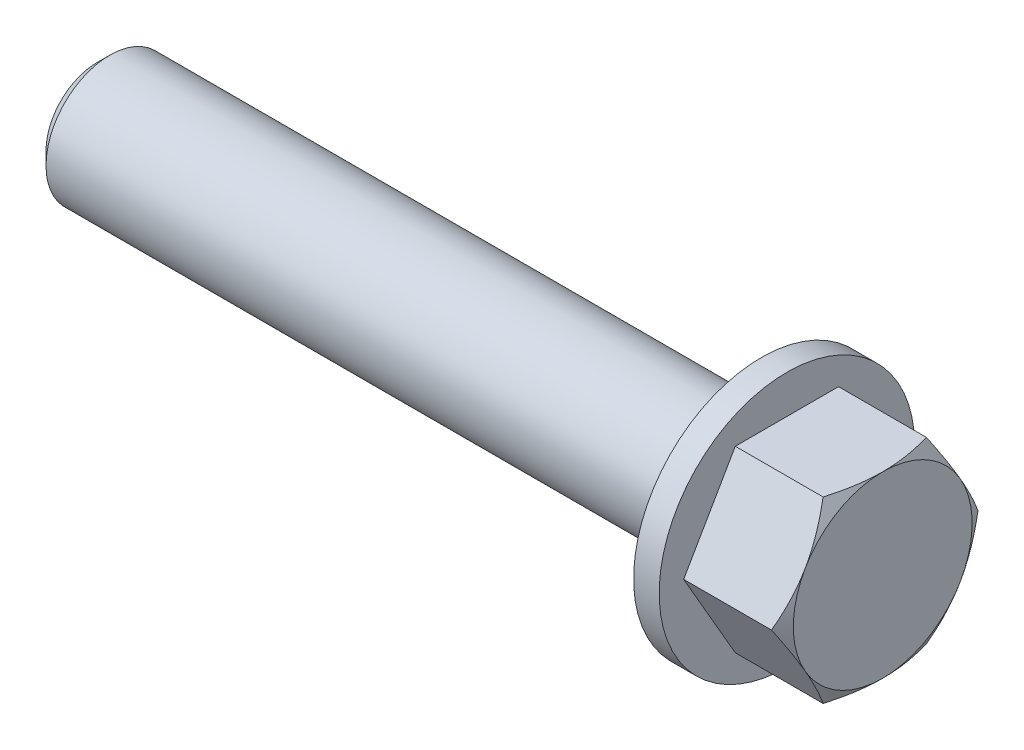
ISO-10303-21;
HEADER;
FILE_DESCRIPTION(('STEP AP214'),'2;1');
FILE_NAME('part.step','',(''),(''),'','','');
FILE_SCHEMA(('AUTOMOTIVE_DESIGN { 1 0 10303 214 1 1 1 1 }'));
ENDSEC;
DATA;
#1=APPLICATION_CONTEXT('core data for automotive mechanical design processes');
#2=APPLICATION_PROTOCOL_DEFINITION('international standard','automotive_design',2000,#1);
#3=PRODUCT_CONTEXT('',#1,'mechanical');
#4=PRODUCT('Part','Part','',(#3));
#5=PRODUCT_RELATED_PRODUCT_CATEGORY('part','',(#4));
#6=PRODUCT_DEFINITION_FORMATION('','',#4);
#7=PRODUCT_DEFINITION_CONTEXT('part definition',#1,'design');
#8=PRODUCT_DEFINITION('design','',#6,#7);
#9=PRODUCT_DEFINITION_SHAPE('','',#8);
#10=(LENGTH_UNIT() NAMED_UNIT(*) SI_UNIT(.MILLI.,.METRE.));
#11=(NAMED_UNIT(*) PLANE_ANGLE_UNIT() SI_UNIT($,.RADIAN.));
#12=(NAMED_UNIT(*) SI_UNIT($,.STERADIAN.) SOLID_ANGLE_UNIT());
#13=UNCERTAINTY_MEASURE_WITH_UNIT(LENGTH_MEASURE(1.E-05),#10,'distance_accuracy_value','');
#14=(GEOMETRIC_REPRESENTATION_CONTEXT(3) GLOBAL_UNCERTAINTY_ASSIGNED_CONTEXT((#13)) GLOBAL_UNIT_ASSIGNED_CONTEXT((#10,
#11,#12)) REPRESENTATION_CONTEXT('',''));
#15=CARTESIAN_POINT('',(0.,0.,0.));
#16=DIRECTION('',(0.,0.,1.));
#17=DIRECTION('',(1.,0.,0.));
#18=AXIS2_PLACEMENT_3D('',#15,#16,#17);
#19=CARTESIAN_POINT('',(7.5,-7.,-4.04145188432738));
#20=DIRECTION('',(0.,0.5,0.866025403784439));
#21=DIRECTION('',(0.,-0.866025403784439,0.5));
#22=AXIS2_PLACEMENT_3D('',#19,#20,#21);
#23=PLANE('',#22);
#24=DIRECTION('',(-1.,0.,0.));
#25=VECTOR('',#24,1.);
#26=CARTESIAN_POINT('',(7.5,0.,-8.08290376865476));
#27=LINE('',#26,#25);
#28=CARTESIAN_POINT('',(6.87478521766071,0.,-8.08290376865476));
#29=VERTEX_POINT('',#28);
#30=CARTESIAN_POINT('',(0.,0.,-8.08290376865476));
#31=VERTEX_POINT('',#30);
#32=EDGE_CURVE('E145',#29,#31,#27,.T.);
#33=ORIENTED_EDGE('',*,*,#32,.F.);
#34=CARTESIAN_POINT('',(6.8747185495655,0.0002,-8.0830192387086));
#35=CARTESIAN_POINT('',(6.92600015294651,-0.153667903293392,-7.99418356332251));
#36=CARTESIAN_POINT('',(6.97495440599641,-0.308109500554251,-7.90501666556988));
#37=CARTESIAN_POINT('',(7.06756721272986,-0.618246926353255,-7.72595873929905));
#38=CARTESIAN_POINT('',(7.11122348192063,-0.773943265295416,-7.63606741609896));
#39=CARTESIAN_POINT('',(7.2333884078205,-1.24352516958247,-7.36495417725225));
#40=CARTESIAN_POINT('',(7.30287444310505,-1.5592643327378,-7.18266208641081));
#41=CARTESIAN_POINT('',(7.3843550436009,-2.03176224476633,-6.9098652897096));
#42=CARTESIAN_POINT('',(7.40756651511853,-2.18710922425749,-6.82017566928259));
#43=CARTESIAN_POINT('',(7.44648878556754,-2.49850511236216,-6.64039116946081));
#44=CARTESIAN_POINT('',(7.46220024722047,-2.65455395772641,-6.55029632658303));
#45=CARTESIAN_POINT('',(7.48572208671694,-2.96692267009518,-6.36995016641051));
#46=CARTESIAN_POINT('',(7.49354143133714,-3.12324202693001,-6.27969914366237));
#47=CARTESIAN_POINT('',(7.50111975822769,-3.43601650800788,-6.09911871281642));
#48=CARTESIAN_POINT('',(7.50087898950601,-3.59247162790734,-6.00878930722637));
#49=CARTESIAN_POINT('',(7.4891402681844,-4.02110687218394,-5.76131663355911));
#50=CARTESIAN_POINT('',(7.46943425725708,-4.2931466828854,-5.60425437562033));
#51=CARTESIAN_POINT('',(7.40694653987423,-4.8354194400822,-5.29117305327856));
#52=CARTESIAN_POINT('',(7.36414347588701,-5.10565047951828,-5.13515508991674));
#53=CARTESIAN_POINT('',(7.25714832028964,-5.64901454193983,-4.82144370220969));
#54=CARTESIAN_POINT('',(7.19250290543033,-5.92207900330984,-4.66378986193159));
#55=CARTESIAN_POINT('',(7.04578392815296,-6.46413578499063,-4.35083323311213));
#56=CARTESIAN_POINT('',(6.96374482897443,-6.73313504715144,-4.19552643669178));
#57=CARTESIAN_POINT('',(6.8747185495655,-7.0002,-4.04133641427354));
#58=B_SPLINE_CURVE_WITH_KNOTS('',3,(#34,#35,#36,#37,#38,#39,#40,#41,#42,#43,#44,#45,#46,#47,#48,
#49,#50,#51,#52,#53,#54,#55,#56,#57),.UNSPECIFIED.,.F.,.F.,(4,2,2,2,2,2,2,2,2,2,2,4),(0.,
0.554727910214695,1.10969417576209,2.2219327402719,2.76443041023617,3.30688013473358,
3.8487128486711,4.39052882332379,5.33376515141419,6.27787517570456,7.2429241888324,
8.20607866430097),.UNSPECIFIED.);
#59=CARTESIAN_POINT('',(7.5,-3.5,-6.06217782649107));
#60=VERTEX_POINT('',#59);
#61=EDGE_CURVE('E228',#29,#60,#58,.T.);
#62=ORIENTED_EDGE('',*,*,#61,.T.);
#63=CARTESIAN_POINT('',(6.87478521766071,-7.,-4.04145188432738));
#64=VERTEX_POINT('',#63);
#65=EDGE_CURVE('E230',#60,#64,#58,.T.);
#66=ORIENTED_EDGE('',*,*,#65,.T.);
#67=DIRECTION('',(-1.,0.,0.));
#68=VECTOR('',#67,1.);
#69=CARTESIAN_POINT('',(7.5,-7.,-4.04145188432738));
#70=LINE('',#69,#68);
#71=CARTESIAN_POINT('',(0.,-7.,-4.04145188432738));
#72=VERTEX_POINT('',#71);
#73=EDGE_CURVE('E117',#64,#72,#70,.T.);
#74=ORIENTED_EDGE('',*,*,#73,.T.);
#75=DIRECTION('',(0.,0.866025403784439,-0.5));
#76=VECTOR('',#75,1.);
#77=CARTESIAN_POINT('',(0.,-7.,-4.04145188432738));
#78=LINE('',#77,#76);
#79=EDGE_CURVE('E113',#72,#31,#78,.T.);
#80=ORIENTED_EDGE('',*,*,#79,.T.);
#81=EDGE_LOOP('',(#33,#62,#66,#74,#80));
#82=FACE_BOUND('',#81,.T.);
#83=ADVANCED_FACE('F36',(#82),#23,.F.);
#84=CARTESIAN_POINT('',(7.5,0.,-8.08290376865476));
#85=DIRECTION('',(0.,-0.5,0.866025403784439));
#86=DIRECTION('',(0.,-0.866025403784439,-0.5));
#87=AXIS2_PLACEMENT_3D('',#84,#85,#86);
#88=PLANE('',#87);
#89=DIRECTION('',(-1.,0.,0.));
#90=VECTOR('',#89,1.);
#91=CARTESIAN_POINT('',(7.5,7.,-4.04145188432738));
#92=LINE('',#91,#90);
#93=CARTESIAN_POINT('',(6.87478521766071,7.,-4.04145188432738));
#94=VERTEX_POINT('',#93);
#95=CARTESIAN_POINT('',(0.,7.,-4.04145188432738));
#96=VERTEX_POINT('',#95);
#97=EDGE_CURVE('E142',#94,#96,#92,.T.);
#98=ORIENTED_EDGE('',*,*,#97,.F.);
#99=CARTESIAN_POINT('',(6.8747185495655,7.0002,-4.04133641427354));
#100=CARTESIAN_POINT('',(6.92600015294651,6.84633209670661,-4.13017208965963));
#101=CARTESIAN_POINT('',(6.97495440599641,6.69189049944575,-4.21933898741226));
#102=CARTESIAN_POINT('',(7.06756721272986,6.38175307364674,-4.39839691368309));
#103=CARTESIAN_POINT('',(7.11122348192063,6.22605673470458,-4.48828823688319));
#104=CARTESIAN_POINT('',(7.2333884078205,5.75647483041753,-4.75940147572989));
#105=CARTESIAN_POINT('',(7.30287444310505,5.4407356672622,-4.94169356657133));
#106=CARTESIAN_POINT('',(7.3843550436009,4.96823775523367,-5.21449036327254));
#107=CARTESIAN_POINT('',(7.40756651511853,4.81289077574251,-5.30417998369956));
#108=CARTESIAN_POINT('',(7.44648878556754,4.50149488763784,-5.48396448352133));
#109=CARTESIAN_POINT('',(7.46220024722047,4.34544604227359,-5.57405932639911));
#110=CARTESIAN_POINT('',(7.48572208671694,4.03307732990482,-5.75440548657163));
#111=CARTESIAN_POINT('',(7.49354143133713,3.87675797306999,-5.84465650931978));
#112=CARTESIAN_POINT('',(7.50111975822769,3.56398349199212,-6.02523694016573));
#113=CARTESIAN_POINT('',(7.50087898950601,3.40752837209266,-6.11556634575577));
#114=CARTESIAN_POINT('',(7.4891402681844,2.97889312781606,-6.36303901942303));
#115=CARTESIAN_POINT('',(7.46943425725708,2.7068533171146,-6.52010127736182));
#116=CARTESIAN_POINT('',(7.40694653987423,2.1645805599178,-6.83318259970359));
#117=CARTESIAN_POINT('',(7.36414347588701,1.89434952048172,-6.9892005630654));
#118=CARTESIAN_POINT('',(7.25714832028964,1.35098545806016,-7.30291195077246));
#119=CARTESIAN_POINT('',(7.19250290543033,1.07792099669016,-7.46056579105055));
#120=CARTESIAN_POINT('',(7.04578392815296,0.535864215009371,-7.77352241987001));
#121=CARTESIAN_POINT('',(6.96374482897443,0.26686495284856,-7.92882921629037));
#122=CARTESIAN_POINT('',(6.8747185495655,-0.000200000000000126,-8.0830192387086));
#123=B_SPLINE_CURVE_WITH_KNOTS('',3,(#99,#100,#101,#102,#103,#104,#105,#106,#107,#108,#109,#110,
#111,#112,#113,#114,#115,#116,#117,#118,#119,#120,#121,#122),.UNSPECIFIED.,.F.,.F.,(4,2,2,2,2,2,
2,2,2,2,2,4),(0.,0.554727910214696,1.10969417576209,2.2219327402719,2.76443041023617,
3.30688013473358,3.8487128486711,4.39052882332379,5.33376515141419,6.27787517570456,
7.2429241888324,8.20607866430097),.UNSPECIFIED.);
#124=CARTESIAN_POINT('',(7.5,3.5,-6.06217782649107));
#125=VERTEX_POINT('',#124);
#126=EDGE_CURVE('E219',#94,#125,#123,.T.);
#127=ORIENTED_EDGE('',*,*,#126,.T.);
#128=EDGE_CURVE('E193',#125,#29,#123,.T.);
#129=ORIENTED_EDGE('',*,*,#128,.T.);
#130=ORIENTED_EDGE('',*,*,#32,.T.);
#131=DIRECTION('',(0.,0.866025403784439,0.5));
#132=VECTOR('',#131,1.);
#133=CARTESIAN_POINT('',(0.,0.,-8.08290376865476));
#134=LINE('',#133,#132);
#135=EDGE_CURVE('E184',#31,#96,#134,.T.);
#136=ORIENTED_EDGE('',*,*,#135,.T.);
#137=EDGE_LOOP('',(#98,#127,#129,#130,#136));
#138=FACE_BOUND('',#137,.T.);
#139=ADVANCED_FACE('F207',(#138),#88,.F.);
#140=CARTESIAN_POINT('',(7.5,7.,-4.04145188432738));
#141=DIRECTION('',(0.,-1.,0.));
#142=DIRECTION('',(0.,0.,-1.));
#143=AXIS2_PLACEMENT_3D('',#140,#141,#142);
#144=PLANE('',#143);
#145=DIRECTION('',(-1.,0.,0.));
#146=VECTOR('',#145,1.);
#147=CARTESIAN_POINT('',(7.5,6.99999999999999,4.04145188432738));
#148=LINE('',#147,#146);
#149=CARTESIAN_POINT('',(6.87478521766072,6.99999999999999,4.04145188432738));
#150=VERTEX_POINT('',#149);
#151=CARTESIAN_POINT('',(0.,6.99999999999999,4.04145188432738));
#152=VERTEX_POINT('',#151);
#153=EDGE_CURVE('E139',#150,#152,#148,.T.);
#154=ORIENTED_EDGE('',*,*,#153,.F.);
#155=CARTESIAN_POINT('',(4.06584479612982,7.00000000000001,-10.8928464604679));
#156=CARTESIAN_POINT('',(4.21450026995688,7.00000000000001,-10.5867029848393));
#157=CARTESIAN_POINT('',(4.36174066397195,7.,-10.2798605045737));
#158=CARTESIAN_POINT('',(4.65259582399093,7.,-9.66440574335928));
#159=CARTESIAN_POINT('',(4.79621002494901,7.,-9.35579319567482));
#160=CARTESIAN_POINT('',(5.07973140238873,7.,-8.73485529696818));
#161=CARTESIAN_POINT('',(5.21961447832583,7.,-8.4225189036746));
#162=CARTESIAN_POINT('',(5.49370236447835,7.,-7.7953737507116));
#163=CARTESIAN_POINT('',(5.62790744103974,7.,-7.48056510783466));
#164=CARTESIAN_POINT('',(5.89331373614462,7.,-6.8378693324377));
#165=CARTESIAN_POINT('',(6.0242822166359,7.,-6.50988555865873));
#166=CARTESIAN_POINT('',(6.27639631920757,7.,-5.85009595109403));
#167=CARTESIAN_POINT('',(6.39754084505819,7.,-5.51828969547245));
#168=CARTESIAN_POINT('',(6.62685500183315,7.,-4.85093135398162));
#169=CARTESIAN_POINT('',(6.73505052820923,7.,-4.51538826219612));
#170=CARTESIAN_POINT('',(6.93502168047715,7.,-3.83950215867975));
#171=CARTESIAN_POINT('',(7.02680243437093,7.,-3.49916068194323));
#172=CARTESIAN_POINT('',(7.1890943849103,7.,-2.81522305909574));
#173=CARTESIAN_POINT('',(7.25971625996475,7.,-2.47165390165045));
#174=CARTESIAN_POINT('',(7.34671847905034,7.,-1.95314285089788));
#175=CARTESIAN_POINT('',(7.37256524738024,7.,-1.77976757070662));
#176=CARTESIAN_POINT('',(7.41744250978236,7.,-1.43214350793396));
#177=CARTESIAN_POINT('',(7.436473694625,7.,-1.25789481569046));
#178=CARTESIAN_POINT('',(7.467100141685,7.,-0.911049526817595));
#179=CARTESIAN_POINT('',(7.47878980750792,7.,-0.738461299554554));
#180=CARTESIAN_POINT('',(7.49485833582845,7.,-0.392945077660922));
#181=CARTESIAN_POINT('',(7.49923732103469,7.,-0.220017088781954));
#182=CARTESIAN_POINT('',(7.50057992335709,7.,0.125872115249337));
#183=CARTESIAN_POINT('',(7.49754340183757,7.,0.2988333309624));
#184=CARTESIAN_POINT('',(7.48412945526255,7.,0.644473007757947));
#185=CARTESIAN_POINT('',(7.47375167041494,7.,0.817151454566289));
#186=CARTESIAN_POINT('',(7.44031338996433,7.,1.23087218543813));
#187=CARTESIAN_POINT('',(7.41384108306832,7.,1.47164462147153));
#188=CARTESIAN_POINT('',(7.34805815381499,7.,1.9514167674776));
#189=CARTESIAN_POINT('',(7.30874582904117,6.99999999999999,2.19041623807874));
#190=CARTESIAN_POINT('',(7.17363274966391,6.99999999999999,2.90445905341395));
#191=CARTESIAN_POINT('',(7.06067846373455,6.99999999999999,3.37630026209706));
#192=CARTESIAN_POINT('',(6.86454385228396,6.99999999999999,4.0821986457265));
#193=CARTESIAN_POINT('',(6.79374157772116,6.99999999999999,4.31990513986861));
#194=CARTESIAN_POINT('',(6.64473048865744,6.99999999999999,4.7930081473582));
#195=CARTESIAN_POINT('',(6.5665216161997,6.99999999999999,5.02840464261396));
#196=CARTESIAN_POINT('',(6.40395697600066,6.99999999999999,5.49696607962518));
#197=CARTESIAN_POINT('',(6.31960307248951,6.99999999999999,5.73013167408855));
#198=CARTESIAN_POINT('',(6.14574648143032,6.99999999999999,6.19452230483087));
#199=CARTESIAN_POINT('',(6.05624392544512,6.99999999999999,6.42574739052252));
#200=CARTESIAN_POINT('',(5.79939160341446,6.99999999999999,7.0713958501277));
#201=CARTESIAN_POINT('',(5.62721890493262,6.99999999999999,7.4838990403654));
#202=CARTESIAN_POINT('',(5.272711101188,6.99999999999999,8.30453182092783));
#203=CARTESIAN_POINT('',(5.09037475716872,6.99999999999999,8.71266087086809));
#204=CARTESIAN_POINT('',(4.71806030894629,6.99999999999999,9.52561092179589));
#205=CARTESIAN_POINT('',(4.52807907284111,6.99999999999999,9.93043048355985));
#206=CARTESIAN_POINT('',(4.14238756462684,6.99999999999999,10.7372987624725));
#207=CARTESIAN_POINT('',(3.94667755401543,6.99999999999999,11.1393476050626));
#208=CARTESIAN_POINT('',(3.55049419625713,6.99999999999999,11.9419246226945));
#209=CARTESIAN_POINT('',(3.35001341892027,6.99999999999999,12.3424491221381));
#210=CARTESIAN_POINT('',(2.94555879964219,6.99999999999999,13.1417322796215));
#211=CARTESIAN_POINT('',(2.7415849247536,6.99999999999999,13.540490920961));
#212=CARTESIAN_POINT('',(2.33090289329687,6.99999999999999,14.3364753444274));
#213=CARTESIAN_POINT('',(2.1241954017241,6.99999999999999,14.7337014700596));
#214=CARTESIAN_POINT('',(1.70852695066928,6.99999999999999,15.526973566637));
#215=CARTESIAN_POINT('',(1.4995659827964,6.99999999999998,15.9230195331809));
#216=CARTESIAN_POINT('',(0.916803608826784,6.99999999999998,17.0213557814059));
#217=CARTESIAN_POINT('',(0.541023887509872,6.99999999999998,17.7225961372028));
#218=CARTESIAN_POINT('',(-0.214721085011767,6.99999999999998,19.1228739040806));
#219=CARTESIAN_POINT('',(-0.594686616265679,6.99999999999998,19.821911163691));
#220=CARTESIAN_POINT('',(-1.35641145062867,6.99999999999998,21.2159219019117));
#221=CARTESIAN_POINT('',(-1.73816026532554,6.99999999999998,21.9109011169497));
#222=CARTESIAN_POINT('',(-2.50401122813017,6.99999999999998,23.2994872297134));
#223=CARTESIAN_POINT('',(-2.8881131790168,6.99999999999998,23.9930942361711));
#224=CARTESIAN_POINT('',(-3.27306517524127,6.99999999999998,24.6862258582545));
#225=B_SPLINE_CURVE_WITH_KNOTS('',3,(#155,#156,#157,#158,#159,#160,#161,#162,#163,#164,#165,
#166,#167,#168,#169,#170,#171,#172,#173,#174,#175,#176,#177,#178,#179,#180,#181,#182,#183,#184,
#185,#186,#187,#188,#189,#190,#191,#192,#193,#194,#195,#196,#197,#198,#199,#200,#201,#202,#203,
#204,#205,#206,#207,#208,#209,#210,#211,#212,#213,#214,#215,#216,#217,#218,#219,#220,#221,#222,
#223,#224),.UNSPECIFIED.,.F.,.F.,(4,2,2,2,2,2,2,2,2,2,2,2,2,2,2,2,2,2,2,2,2,2,2,2,2,2,2,2,2,2,2,
2,2,2,4),(0.,1.02099246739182,2.04214305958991,3.06878742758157,4.09538358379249,
5.15475890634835,6.21425227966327,7.27159015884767,8.32859714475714,9.37997449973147,
9.90573557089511,10.4314433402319,10.9502447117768,11.469037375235,11.9878397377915,
12.5066675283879,13.2329284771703,13.9592857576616,15.4127396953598,16.1567571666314,
16.9007804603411,17.6445789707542,18.3883584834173,19.7291255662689,21.070056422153,
22.4115423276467,23.7529670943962,25.0966389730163,26.4403235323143,27.7836870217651,
29.1270555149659,31.5137750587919,33.9006552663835,36.2794216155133,38.6579912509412),.UNSPECIFIED.);
#226=CARTESIAN_POINT('',(7.5,7.,0.));
#227=VERTEX_POINT('',#226);
#228=EDGE_CURVE('E176',#150,#227,#225,.F.);
#229=ORIENTED_EDGE('',*,*,#228,.T.);
#230=EDGE_CURVE('E178',#227,#94,#225,.F.);
#231=ORIENTED_EDGE('',*,*,#230,.T.);
#232=ORIENTED_EDGE('',*,*,#97,.T.);
#233=DIRECTION('',(0.,0.,1.));
#234=VECTOR('',#233,1.);
#235=CARTESIAN_POINT('',(0.,7.,-4.04145188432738));
#236=LINE('',#235,#234);
#237=EDGE_CURVE('E133',#96,#152,#236,.T.);
#238=ORIENTED_EDGE('',*,*,#237,.T.);
#239=EDGE_LOOP('',(#154,#229,#231,#232,#238));
#240=FACE_BOUND('',#239,.T.);
#241=ADVANCED_FACE('F177',(#240),#144,.F.);
#242=CARTESIAN_POINT('',(7.5,6.99999999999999,4.04145188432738));
#243=DIRECTION('',(0.,-0.5,-0.866025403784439));
#244=DIRECTION('',(0.,0.866025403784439,-0.5));
#245=AXIS2_PLACEMENT_3D('',#242,#243,#244);
#246=PLANE('',#245);
#247=DIRECTION('',(-1.,0.,0.));
#248=VECTOR('',#247,1.);
#249=CARTESIAN_POINT('',(7.5,0.,8.08290376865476));
#250=LINE('',#249,#248);
#251=CARTESIAN_POINT('',(6.87478521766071,0.,8.08290376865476));
#252=VERTEX_POINT('',#251);
#253=CARTESIAN_POINT('',(0.,0.,8.08290376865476));
#254=VERTEX_POINT('',#253);
#255=EDGE_CURVE('E125',#252,#254,#250,.T.);
#256=ORIENTED_EDGE('',*,*,#255,.F.);
#257=CARTESIAN_POINT('',(6.8747185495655,-0.000200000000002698,8.0830192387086));
#258=CARTESIAN_POINT('',(6.92600015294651,0.153667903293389,7.99418356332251));
#259=CARTESIAN_POINT('',(6.97495440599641,0.308109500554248,7.90501666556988));
#260=CARTESIAN_POINT('',(7.06756721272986,0.618246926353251,7.72595873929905));
#261=CARTESIAN_POINT('',(7.11122348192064,0.773943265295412,7.63606741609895));
#262=CARTESIAN_POINT('',(7.23338840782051,1.24352516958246,7.36495417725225));
#263=CARTESIAN_POINT('',(7.30287444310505,1.5592643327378,7.18266208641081));
#264=CARTESIAN_POINT('',(7.3843550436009,2.03176224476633,6.9098652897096));
#265=CARTESIAN_POINT('',(7.40756651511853,2.18710922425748,6.82017566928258));
#266=CARTESIAN_POINT('',(7.44648878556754,2.49850511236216,6.64039116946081));
#267=CARTESIAN_POINT('',(7.46220024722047,2.65455395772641,6.55029632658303));
#268=CARTESIAN_POINT('',(7.48572208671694,2.96692267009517,6.36995016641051));
#269=CARTESIAN_POINT('',(7.49354143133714,3.12324202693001,6.27969914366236));
#270=CARTESIAN_POINT('',(7.5011197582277,3.43601650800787,6.09911871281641));
#271=CARTESIAN_POINT('',(7.50087898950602,3.59247162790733,6.00878930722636));
#272=CARTESIAN_POINT('',(7.4891402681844,4.02110687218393,5.76131663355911));
#273=CARTESIAN_POINT('',(7.46943425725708,4.2931466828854,5.60425437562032));
#274=CARTESIAN_POINT('',(7.40694653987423,4.83541944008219,5.29117305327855));
#275=CARTESIAN_POINT('',(7.36414347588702,5.10565047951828,5.13515508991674));
#276=CARTESIAN_POINT('',(7.25714832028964,5.64901454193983,4.82144370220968));
#277=CARTESIAN_POINT('',(7.19250290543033,5.92207900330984,4.66378986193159));
#278=CARTESIAN_POINT('',(7.04578392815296,6.46413578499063,4.35083323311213));
#279=CARTESIAN_POINT('',(6.96374482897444,6.73313504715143,4.19552643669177));
#280=CARTESIAN_POINT('',(6.8747185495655,7.00019999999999,4.04133641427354));
#281=B_SPLINE_CURVE_WITH_KNOTS('',3,(#257,#258,#259,#260,#261,#262,#263,#264,#265,#266,#267,
#268,#269,#270,#271,#272,#273,#274,#275,#276,#277,#278,#279,#280),.UNSPECIFIED.,.F.,.F.,(4,2,2,
2,2,2,2,2,2,2,2,4),(0.,0.554727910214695,1.10969417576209,2.2219327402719,2.76443041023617,
3.30688013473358,3.8487128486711,4.39052882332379,5.33376515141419,6.27787517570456,
7.2429241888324,8.20607866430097),.UNSPECIFIED.);
#282=CARTESIAN_POINT('',(7.5,3.5,6.06217782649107));
#283=VERTEX_POINT('',#282);
#284=EDGE_CURVE('E221',#252,#283,#281,.T.);
#285=ORIENTED_EDGE('',*,*,#284,.T.);
#286=EDGE_CURVE('E186',#283,#150,#281,.T.);
#287=ORIENTED_EDGE('',*,*,#286,.T.);
#288=ORIENTED_EDGE('',*,*,#153,.T.);
#289=DIRECTION('',(0.,-0.866025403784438,0.5));
#290=VECTOR('',#289,1.);
#291=CARTESIAN_POINT('',(0.,6.99999999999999,4.04145188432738));
#292=LINE('',#291,#290);
#293=EDGE_CURVE('E131',#152,#254,#292,.T.);
#294=ORIENTED_EDGE('',*,*,#293,.T.);
#295=EDGE_LOOP('',(#256,#285,#287,#288,#294));
#296=FACE_BOUND('',#295,.T.);
#297=ADVANCED_FACE('F206',(#296),#246,.F.);
#298=CARTESIAN_POINT('',(7.5,0.,8.08290376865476));
#299=DIRECTION('',(0.,0.5,-0.866025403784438));
#300=DIRECTION('',(0.,0.866025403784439,0.5));
#301=AXIS2_PLACEMENT_3D('',#298,#299,#300);
#302=PLANE('',#301);
#303=DIRECTION('',(-1.,0.,0.));
#304=VECTOR('',#303,1.);
#305=CARTESIAN_POINT('',(7.5,-7.,4.04145188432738));
#306=LINE('',#305,#304);
#307=CARTESIAN_POINT('',(6.87478521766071,-7.,4.04145188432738));
#308=VERTEX_POINT('',#307);
#309=CARTESIAN_POINT('',(0.,-7.,4.04145188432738));
#310=VERTEX_POINT('',#309);
#311=EDGE_CURVE('E120',#308,#310,#306,.T.);
#312=ORIENTED_EDGE('',*,*,#311,.F.);
#313=CARTESIAN_POINT('',(6.8747185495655,-7.0002,4.04133641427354));
#314=CARTESIAN_POINT('',(6.92600015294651,-6.84633209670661,4.13017208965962));
#315=CARTESIAN_POINT('',(6.97495440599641,-6.69189049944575,4.21933898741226));
#316=CARTESIAN_POINT('',(7.06756721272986,-6.38175307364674,4.39839691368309));
#317=CARTESIAN_POINT('',(7.11122348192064,-6.22605673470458,4.48828823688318));
#318=CARTESIAN_POINT('',(7.2333884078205,-5.75647483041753,4.75940147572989));
#319=CARTESIAN_POINT('',(7.30287444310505,-5.4407356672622,4.94169356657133));
#320=CARTESIAN_POINT('',(7.3843550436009,-4.96823775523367,5.21449036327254));
#321=CARTESIAN_POINT('',(7.40756651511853,-4.81289077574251,5.30417998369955));
#322=CARTESIAN_POINT('',(7.44648878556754,-4.50149488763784,5.48396448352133));
#323=CARTESIAN_POINT('',(7.46220024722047,-4.34544604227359,5.57405932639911));
#324=CARTESIAN_POINT('',(7.48572208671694,-4.03307732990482,5.75440548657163));
#325=CARTESIAN_POINT('',(7.49354143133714,-3.87675797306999,5.84465650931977));
#326=CARTESIAN_POINT('',(7.50111975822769,-3.56398349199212,6.02523694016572));
#327=CARTESIAN_POINT('',(7.50087898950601,-3.40752837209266,6.11556634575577));
#328=CARTESIAN_POINT('',(7.4891402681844,-2.97889312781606,6.36303901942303));
#329=CARTESIAN_POINT('',(7.46943425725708,-2.7068533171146,6.52010127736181));
#330=CARTESIAN_POINT('',(7.40694653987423,-2.1645805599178,6.83318259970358));
#331=CARTESIAN_POINT('',(7.36414347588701,-1.89434952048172,6.9892005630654));
#332=CARTESIAN_POINT('',(7.25714832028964,-1.35098545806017,7.30291195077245));
#333=CARTESIAN_POINT('',(7.19250290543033,-1.07792099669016,7.46056579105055));
#334=CARTESIAN_POINT('',(7.04578392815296,-0.535864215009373,7.77352241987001));
#335=CARTESIAN_POINT('',(6.96374482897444,-0.266864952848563,7.92882921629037));
#336=CARTESIAN_POINT('',(6.8747185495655,0.000199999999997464,8.0830192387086));
#337=B_SPLINE_CURVE_WITH_KNOTS('',3,(#313,#314,#315,#316,#317,#318,#319,#320,#321,#322,#323,
#324,#325,#326,#327,#328,#329,#330,#331,#332,#333,#334,#335,#336),.UNSPECIFIED.,.F.,.F.,(4,2,2,
2,2,2,2,2,2,2,2,4),(0.,0.554727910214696,1.10969417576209,2.2219327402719,2.76443041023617,
3.30688013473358,3.8487128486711,4.39052882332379,5.33376515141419,6.27787517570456,
7.2429241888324,8.20607866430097),.UNSPECIFIED.);
#338=CARTESIAN_POINT('',(7.5,-3.5,6.06217782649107));
#339=VERTEX_POINT('',#338);
#340=EDGE_CURVE('E56',#308,#339,#337,.T.);
#341=ORIENTED_EDGE('',*,*,#340,.T.);
#342=EDGE_CURVE('E227',#339,#252,#337,.T.);
#343=ORIENTED_EDGE('',*,*,#342,.T.);
#344=ORIENTED_EDGE('',*,*,#255,.T.);
#345=DIRECTION('',(0.,-0.866025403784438,-0.5));
#346=VECTOR('',#345,1.);
#347=CARTESIAN_POINT('',(0.,0.,8.08290376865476));
#348=LINE('',#347,#346);
#349=EDGE_CURVE('E110',#254,#310,#348,.T.);
#350=ORIENTED_EDGE('',*,*,#349,.T.);
#351=EDGE_LOOP('',(#312,#341,#343,#344,#350));
#352=FACE_BOUND('',#351,.T.);
#353=ADVANCED_FACE('F127',(#352),#302,.F.);
#354=CARTESIAN_POINT('',(7.5,-7.,4.04145188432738));
#355=DIRECTION('',(0.,1.,0.));
#356=DIRECTION('',(0.,0.,1.));
#357=AXIS2_PLACEMENT_3D('',#354,#355,#356);
#358=PLANE('',#357);
#359=ORIENTED_EDGE('',*,*,#73,.F.);
#360=CARTESIAN_POINT('',(4.06584479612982,-7.,-10.8928464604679));
#361=CARTESIAN_POINT('',(4.21450026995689,-7.,-10.5867029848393));
#362=CARTESIAN_POINT('',(4.36174066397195,-7.,-10.2798605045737));
#363=CARTESIAN_POINT('',(4.65259582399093,-7.,-9.66440574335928));
#364=CARTESIAN_POINT('',(4.79621002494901,-7.,-9.35579319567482));
#365=CARTESIAN_POINT('',(5.07973140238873,-7.,-8.73485529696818));
#366=CARTESIAN_POINT('',(5.21961447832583,-7.,-8.4225189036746));
#367=CARTESIAN_POINT('',(5.49370236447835,-7.,-7.7953737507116));
#368=CARTESIAN_POINT('',(5.62790744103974,-7.,-7.48056510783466));
#369=CARTESIAN_POINT('',(5.89331373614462,-7.,-6.8378693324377));
#370=CARTESIAN_POINT('',(6.0242822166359,-7.,-6.50988555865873));
#371=CARTESIAN_POINT('',(6.27639631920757,-7.,-5.85009595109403));
#372=CARTESIAN_POINT('',(6.39754084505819,-7.,-5.51828969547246));
#373=CARTESIAN_POINT('',(6.62685500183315,-7.,-4.85093135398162));
#374=CARTESIAN_POINT('',(6.73505052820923,-7.,-4.51538826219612));
#375=CARTESIAN_POINT('',(6.93502168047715,-7.,-3.83950215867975));
#376=CARTESIAN_POINT('',(7.02680243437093,-7.,-3.49916068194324));
#377=CARTESIAN_POINT('',(7.1890943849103,-7.,-2.81522305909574));
#378=CARTESIAN_POINT('',(7.25971625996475,-7.,-2.47165390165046));
#379=CARTESIAN_POINT('',(7.34671847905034,-7.,-1.95314285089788));
#380=CARTESIAN_POINT('',(7.37256524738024,-7.,-1.77976757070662));
#381=CARTESIAN_POINT('',(7.41744250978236,-7.,-1.43214350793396));
#382=CARTESIAN_POINT('',(7.436473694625,-7.,-1.25789481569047));
#383=CARTESIAN_POINT('',(7.467100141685,-7.,-0.911049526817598));
#384=CARTESIAN_POINT('',(7.47878980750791,-7.,-0.738461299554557));
#385=CARTESIAN_POINT('',(7.49485833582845,-7.,-0.392945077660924));
#386=CARTESIAN_POINT('',(7.49923732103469,-7.,-0.220017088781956));
#387=CARTESIAN_POINT('',(7.50057992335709,-7.,0.125872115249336));
#388=CARTESIAN_POINT('',(7.49754340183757,-7.,0.2988333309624));
#389=CARTESIAN_POINT('',(7.48412945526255,-7.,0.644473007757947));
#390=CARTESIAN_POINT('',(7.47375167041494,-7.,0.81715145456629));
#391=CARTESIAN_POINT('',(7.44031338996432,-7.,1.23087218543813));
#392=CARTESIAN_POINT('',(7.41384108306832,-7.,1.47164462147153));
#393=CARTESIAN_POINT('',(7.34805815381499,-7.,1.9514167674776));
#394=CARTESIAN_POINT('',(7.30874582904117,-7.,2.19041623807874));
#395=CARTESIAN_POINT('',(7.17363274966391,-7.,2.90445905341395));
#396=CARTESIAN_POINT('',(7.06067846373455,-7.,3.37630026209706));
#397=CARTESIAN_POINT('',(6.86454385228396,-7.,4.0821986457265));
#398=CARTESIAN_POINT('',(6.79374157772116,-7.,4.31990513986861));
#399=CARTESIAN_POINT('',(6.64473048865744,-7.,4.7930081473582));
#400=CARTESIAN_POINT('',(6.56652161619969,-7.,5.02840464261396));
#401=CARTESIAN_POINT('',(6.40395697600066,-7.,5.49696607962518));
#402=CARTESIAN_POINT('',(6.3196030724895,-7.,5.73013167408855));
#403=CARTESIAN_POINT('',(6.14574648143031,-7.,6.19452230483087));
#404=CARTESIAN_POINT('',(6.05624392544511,-7.,6.42574739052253));
#405=CARTESIAN_POINT('',(5.79939160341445,-7.,7.07139585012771));
#406=CARTESIAN_POINT('',(5.62721890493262,-7.,7.4838990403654));
#407=CARTESIAN_POINT('',(5.27271110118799,-7.,8.30453182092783));
#408=CARTESIAN_POINT('',(5.09037475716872,-7.,8.71266087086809));
#409=CARTESIAN_POINT('',(4.71806030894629,-7.,9.52561092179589));
#410=CARTESIAN_POINT('',(4.5280790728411,-7.,9.93043048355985));
#411=CARTESIAN_POINT('',(4.14238756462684,-7.,10.7372987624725));
#412=CARTESIAN_POINT('',(3.94667755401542,-7.,11.1393476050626));
#413=CARTESIAN_POINT('',(3.55049419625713,-7.,11.9419246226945));
#414=CARTESIAN_POINT('',(3.35001341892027,-7.,12.3424491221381));
#415=CARTESIAN_POINT('',(2.94555879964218,-7.,13.1417322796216));
#416=CARTESIAN_POINT('',(2.7415849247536,-7.,13.540490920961));
#417=CARTESIAN_POINT('',(2.33090289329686,-7.,14.3364753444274));
#418=CARTESIAN_POINT('',(2.12419540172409,-7.,14.7337014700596));
#419=CARTESIAN_POINT('',(1.70852695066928,-7.,15.526973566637));
#420=CARTESIAN_POINT('',(1.4995659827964,-7.,15.9230195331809));
#421=CARTESIAN_POINT('',(0.91680360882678,-7.,17.0213557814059));
#422=CARTESIAN_POINT('',(0.541023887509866,-7.,17.7225961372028));
#423=CARTESIAN_POINT('',(-0.214721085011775,-7.,19.1228739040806));
#424=CARTESIAN_POINT('',(-0.594686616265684,-7.,19.821911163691));
#425=CARTESIAN_POINT('',(-1.35641145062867,-7.,21.2159219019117));
#426=CARTESIAN_POINT('',(-1.73816026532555,-7.,21.9109011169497));
#427=CARTESIAN_POINT('',(-2.50401122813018,-7.,23.2994872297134));
#428=CARTESIAN_POINT('',(-2.88811317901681,-7.,23.9930942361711));
#429=CARTESIAN_POINT('',(-3.27306517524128,-7.,24.6862258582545));
#430=B_SPLINE_CURVE_WITH_KNOTS('',3,(#360,#361,#362,#363,#364,#365,#366,#367,#368,#369,#370,
#371,#372,#373,#374,#375,#376,#377,#378,#379,#380,#381,#382,#383,#384,#385,#386,#387,#388,#389,
#390,#391,#392,#393,#394,#395,#396,#397,#398,#399,#400,#401,#402,#403,#404,#405,#406,#407,#408,
#409,#410,#411,#412,#413,#414,#415,#416,#417,#418,#419,#420,#421,#422,#423,#424,#425,#426,#427,
#428,#429),.UNSPECIFIED.,.F.,.F.,(4,2,2,2,2,2,2,2,2,2,2,2,2,2,2,2,2,2,2,2,2,2,2,2,2,2,2,2,2,2,2,
2,2,2,4),(0.,1.02099246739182,2.04214305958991,3.06878742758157,4.09538358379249,
5.15475890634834,6.21425227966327,7.27159015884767,8.32859714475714,9.37997449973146,
9.9057355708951,10.4314433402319,10.9502447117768,11.469037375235,11.9878397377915,
12.5066675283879,13.2329284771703,13.9592857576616,15.4127396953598,16.1567571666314,
16.9007804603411,17.6445789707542,18.3883584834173,19.7291255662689,21.070056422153,
22.4115423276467,23.7529670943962,25.0966389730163,26.4403235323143,27.7836870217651,
29.1270555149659,31.5137750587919,33.9006552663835,36.2794216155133,38.6579912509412),.UNSPECIFIED.);
#431=CARTESIAN_POINT('',(7.5,-7.,0.));
#432=VERTEX_POINT('',#431);
#433=EDGE_CURVE('E235',#64,#432,#430,.T.);
#434=ORIENTED_EDGE('',*,*,#433,.T.);
#435=EDGE_CURVE('E123',#432,#308,#430,.T.);
#436=ORIENTED_EDGE('',*,*,#435,.T.);
#437=ORIENTED_EDGE('',*,*,#311,.T.);
#438=DIRECTION('',(0.,0.,-1.));
#439=VECTOR('',#438,1.);
#440=CARTESIAN_POINT('',(0.,-7.,4.04145188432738));
#441=LINE('',#440,#439);
#442=EDGE_CURVE('E106',#310,#72,#441,.T.);
#443=ORIENTED_EDGE('',*,*,#442,.T.);
#444=EDGE_LOOP('',(#359,#434,#436,#437,#443));
#445=FACE_BOUND('',#444,.T.);
#446=ADVANCED_FACE('F121',(#445),#358,.F.);
#447=CARTESIAN_POINT('',(7.5,0.,0.));
#448=DIRECTION('',(-1.,0.,0.));
#449=DIRECTION('',(0.,0.,1.));
#450=AXIS2_PLACEMENT_3D('',#447,#448,#449);
#451=CONICAL_SURFACE('',#450,7.,1.0471975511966);
#452=ORIENTED_EDGE('',*,*,#342,.F.);
#453=CARTESIAN_POINT('',(7.5,0.,0.));
#454=DIRECTION('',(-1.,0.,0.));
#455=DIRECTION('',(0.,0.,1.));
#456=AXIS2_PLACEMENT_3D('',#453,#454,#455);
#457=CIRCLE('',#456,7.);
#458=EDGE_CURVE('E148',#283,#339,#457,.F.);
#459=ORIENTED_EDGE('',*,*,#458,.F.);
#460=ORIENTED_EDGE('',*,*,#284,.F.);
#461=EDGE_LOOP('',(#452,#459,#460));
#462=FACE_BOUND('',#461,.T.);
#463=ADVANCED_FACE('F246',(#462),#451,.T.);
#464=ORIENTED_EDGE('',*,*,#286,.F.);
#465=CARTESIAN_POINT('',(7.5,0.,0.));
#466=DIRECTION('',(-1.,0.,0.));
#467=DIRECTION('',(0.,0.,1.));
#468=AXIS2_PLACEMENT_3D('',#465,#466,#467);
#469=CIRCLE('',#468,7.);
#470=EDGE_CURVE('E170',#283,#227,#469,.T.);
#471=ORIENTED_EDGE('',*,*,#470,.T.);
#472=ORIENTED_EDGE('',*,*,#228,.F.);
#473=EDGE_LOOP('',(#464,#471,#472));
#474=FACE_BOUND('',#473,.T.);
#475=ADVANCED_FACE('F199',(#474),#451,.T.);
#476=EDGE_CURVE('E151',#125,#227,#457,.F.);
#477=ORIENTED_EDGE('',*,*,#476,.F.);
#478=ORIENTED_EDGE('',*,*,#126,.F.);
#479=ORIENTED_EDGE('',*,*,#230,.F.);
#480=EDGE_LOOP('',(#477,#478,#479));
#481=FACE_BOUND('',#480,.T.);
#482=ADVANCED_FACE('F328',(#481),#451,.T.);
#483=EDGE_CURVE('E158',#60,#125,#457,.F.);
#484=ORIENTED_EDGE('',*,*,#483,.F.);
#485=ORIENTED_EDGE('',*,*,#61,.F.);
#486=ORIENTED_EDGE('',*,*,#128,.F.);
#487=EDGE_LOOP('',(#484,#485,#486));
#488=FACE_BOUND('',#487,.T.);
#489=ADVANCED_FACE('F319',(#488),#451,.T.);
#490=EDGE_CURVE('E155',#432,#60,#457,.F.);
#491=ORIENTED_EDGE('',*,*,#490,.F.);
#492=ORIENTED_EDGE('',*,*,#433,.F.);
#493=ORIENTED_EDGE('',*,*,#65,.F.);
#494=EDGE_LOOP('',(#491,#492,#493));
#495=FACE_BOUND('',#494,.T.);
#496=ADVANCED_FACE('F311',(#495),#451,.T.);
#497=ORIENTED_EDGE('',*,*,#435,.F.);
#498=EDGE_CURVE('E52',#339,#432,#457,.F.);
#499=ORIENTED_EDGE('',*,*,#498,.F.);
#500=ORIENTED_EDGE('',*,*,#340,.F.);
#501=EDGE_LOOP('',(#497,#499,#500));
#502=FACE_BOUND('',#501,.T.);
#503=ADVANCED_FACE('F302',(#502),#451,.T.);
#504=CARTESIAN_POINT('',(7.5,-7.,-4.04145188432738));
#505=DIRECTION('',(-1.,0.,0.));
#506=DIRECTION('',(0.,0.,1.));
#507=AXIS2_PLACEMENT_3D('',#504,#505,#506);
#508=PLANE('',#507);
#509=ORIENTED_EDGE('',*,*,#458,.T.);
#510=ORIENTED_EDGE('',*,*,#498,.T.);
#511=ORIENTED_EDGE('',*,*,#490,.T.);
#512=ORIENTED_EDGE('',*,*,#483,.T.);
#513=ORIENTED_EDGE('',*,*,#476,.T.);
#514=ORIENTED_EDGE('',*,*,#470,.F.);
#515=EDGE_LOOP('',(#509,#510,#511,#512,#513,#514));
#516=FACE_BOUND('',#515,.T.);
#517=ADVANCED_FACE('F168',(#516),#508,.F.);
#518=CARTESIAN_POINT('',(0.,0.,0.));
#519=DIRECTION('',(1.,0.,0.));
#520=DIRECTION('',(0.,0.,-1.));
#521=AXIS2_PLACEMENT_3D('',#518,#519,#520);
#522=PLANE('',#521);
#523=CARTESIAN_POINT('',(0.,0.,0.));
#524=DIRECTION('',(1.,0.,0.));
#525=DIRECTION('',(0.,0.,-1.));
#526=AXIS2_PLACEMENT_3D('',#523,#524,#525);
#527=CIRCLE('',#526,10.);
#528=CARTESIAN_POINT('',(0.,0.,-10.));
#529=VERTEX_POINT('',#528);
#530=EDGE_CURVE('E422',#529,#529,#527,.T.);
#531=ORIENTED_EDGE('',*,*,#530,.T.);
#532=EDGE_LOOP('',(#531));
#533=FACE_BOUND('',#532,.T.);
#534=ORIENTED_EDGE('',*,*,#79,.F.);
#535=ORIENTED_EDGE('',*,*,#442,.F.);
#536=ORIENTED_EDGE('',*,*,#349,.F.);
#537=ORIENTED_EDGE('',*,*,#293,.F.);
#538=ORIENTED_EDGE('',*,*,#237,.F.);
#539=ORIENTED_EDGE('',*,*,#135,.F.);
#540=EDGE_LOOP('',(#534,#535,#536,#537,#538,#539));
#541=FACE_BOUND('',#540,.T.);
#542=ADVANCED_FACE('F108',(#533,#541),#522,.T.);
#543=CARTESIAN_POINT('',(-2.,0.,0.));
#544=DIRECTION('',(-1.,0.,0.));
#545=DIRECTION('',(0.,0.,1.));
#546=AXIS2_PLACEMENT_3D('',#543,#544,#545);
#547=PLANE('',#546);
#548=CARTESIAN_POINT('',(-2.,0.,0.));
#549=DIRECTION('',(1.,0.,0.));
#550=DIRECTION('',(0.,0.,-1.));
#551=AXIS2_PLACEMENT_3D('',#548,#549,#550);
#552=CIRCLE('',#551,10.);
#553=CARTESIAN_POINT('',(-2.,0.,-10.));
#554=VERTEX_POINT('',#553);
#555=EDGE_CURVE('E424',#554,#554,#552,.T.);
#556=ORIENTED_EDGE('',*,*,#555,.F.);
#557=EDGE_LOOP('',(#556));
#558=FACE_BOUND('',#557,.T.);
#559=CARTESIAN_POINT('',(-2.,0.,0.));
#560=DIRECTION('',(-1.,0.,0.));
#561=DIRECTION('',(0.,0.,1.));
#562=AXIS2_PLACEMENT_3D('',#559,#560,#561);
#563=CIRCLE('',#562,5.);
#564=CARTESIAN_POINT('',(-2.,0.,5.));
#565=VERTEX_POINT('',#564);
#566=EDGE_CURVE('E40',#565,#565,#563,.T.);
#567=ORIENTED_EDGE('',*,*,#566,.F.);
#568=EDGE_LOOP('',(#567));
#569=FACE_BOUND('',#568,.T.);
#570=ADVANCED_FACE('F376',(#558,#569),#547,.T.);
#571=CARTESIAN_POINT('',(0.,0.,0.));
#572=DIRECTION('',(1.,0.,0.));
#573=DIRECTION('',(0.,0.,-1.));
#574=AXIS2_PLACEMENT_3D('',#571,#572,#573);
#575=CYLINDRICAL_SURFACE('',#574,10.);
#576=ORIENTED_EDGE('',*,*,#555,.T.);
#577=EDGE_LOOP('',(#576));
#578=FACE_BOUND('',#577,.T.);
#579=ORIENTED_EDGE('',*,*,#530,.F.);
#580=EDGE_LOOP('',(#579));
#581=FACE_BOUND('',#580,.T.);
#582=ADVANCED_FACE('F291',(#578,#581),#575,.T.);
#583=CARTESIAN_POINT('',(-54.,0.,0.));
#584=DIRECTION('',(-1.,0.,0.));
#585=DIRECTION('',(0.,0.,1.));
#586=AXIS2_PLACEMENT_3D('',#583,#584,#585);
#587=PLANE('',#586);
#588=CARTESIAN_POINT('',(-54.,0.,0.));
#589=DIRECTION('',(-1.,0.,0.));
#590=DIRECTION('',(0.,0.,1.));
#591=AXIS2_PLACEMENT_3D('',#588,#589,#590);
#592=CIRCLE('',#591,4.);
#593=CARTESIAN_POINT('',(-54.,0.,4.));
#594=VERTEX_POINT('',#593);
#595=EDGE_CURVE('E45',#594,#594,#592,.T.);
#596=ORIENTED_EDGE('',*,*,#595,.T.);
#597=EDGE_LOOP('',(#596));
#598=FACE_BOUND('',#597,.T.);
#599=ADVANCED_FACE('F279',(#598),#587,.T.);
#600=CARTESIAN_POINT('',(-54.,0.,0.));
#601=DIRECTION('',(1.,0.,0.));
#602=DIRECTION('',(0.,0.,-1.));
#603=AXIS2_PLACEMENT_3D('',#600,#601,#602);
#604=CONICAL_SURFACE('',#603,4.,0.785398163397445);
#605=CARTESIAN_POINT('',(-53.,0.,0.));
#606=DIRECTION('',(-1.,0.,0.));
#607=DIRECTION('',(0.,0.,1.));
#608=AXIS2_PLACEMENT_3D('',#605,#606,#607);
#609=CIRCLE('',#608,5.);
#610=CARTESIAN_POINT('',(-53.,0.,5.));
#611=VERTEX_POINT('',#610);
#612=EDGE_CURVE('E11',#611,#611,#609,.F.);
#613=ORIENTED_EDGE('',*,*,#612,.F.);
#614=EDGE_LOOP('',(#613));
#615=FACE_BOUND('',#614,.T.);
#616=ORIENTED_EDGE('',*,*,#595,.F.);
#617=EDGE_LOOP('',(#616));
#618=FACE_BOUND('',#617,.T.);
#619=ADVANCED_FACE('F272',(#615,#618),#604,.T.);
#620=CARTESIAN_POINT('',(-54.,0.,0.));
#621=DIRECTION('',(1.,0.,0.));
#622=DIRECTION('',(0.,0.,-1.));
#623=AXIS2_PLACEMENT_3D('',#620,#621,#622);
#624=CYLINDRICAL_SURFACE('',#623,5.);
#625=ORIENTED_EDGE('',*,*,#612,.T.);
#626=EDGE_LOOP('',(#625));
#627=FACE_BOUND('',#626,.T.);
#628=ORIENTED_EDGE('',*,*,#566,.T.);
#629=EDGE_LOOP('',(#628));
#630=FACE_BOUND('',#629,.T.);
#631=ADVANCED_FACE('F278',(#627,#630),#624,.T.);
#632=CLOSED_SHELL('',(#83,#139,#241,#297,#353,#446,#463,#475,#482,#489,#496,#503,#517,#542,#570,
#582,#599,#619,#631));
#633=MANIFOLD_SOLID_BREP('B2',#632);
#634=ADVANCED_BREP_SHAPE_REPRESENTATION('',(#18,#633),#14);
#635=SHAPE_DEFINITION_REPRESENTATION(#9,#634);
ENDSEC;
END-ISO-10303-21;
